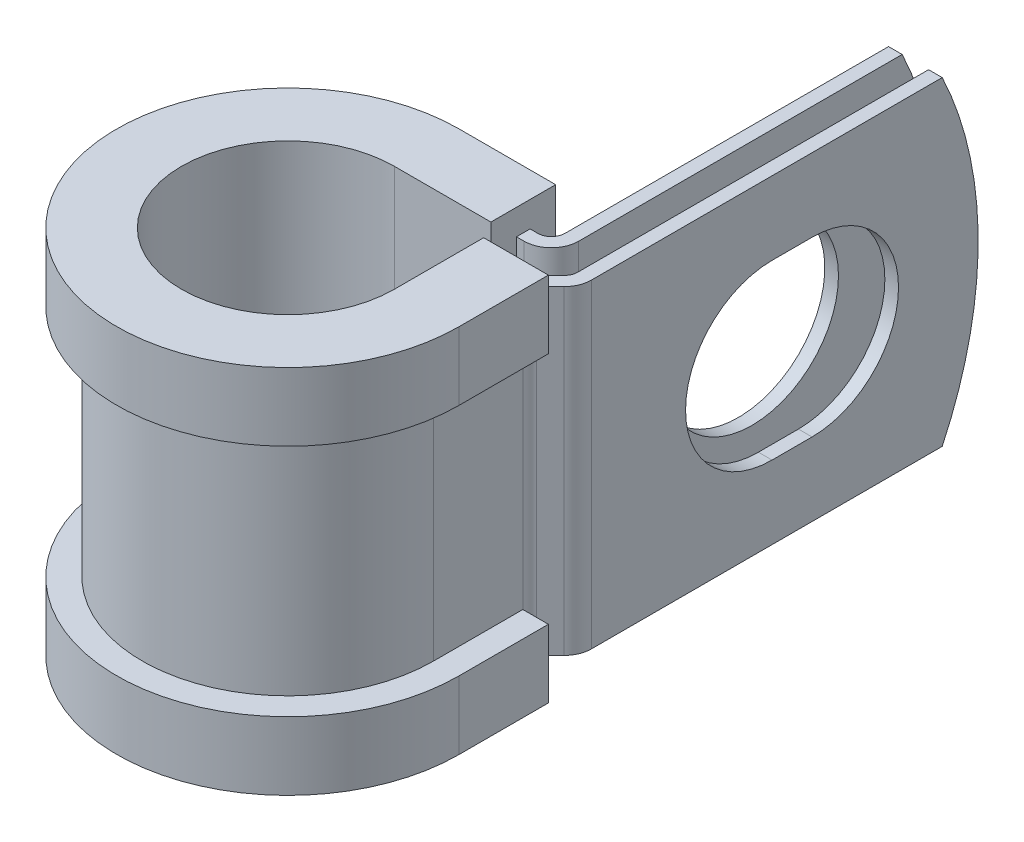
ISO-10303-21;
HEADER;
FILE_DESCRIPTION(('STEP AP214'),'2;1');
FILE_NAME('part.step','',(''),(''),'','','');
FILE_SCHEMA(('AUTOMOTIVE_DESIGN { 1 0 10303 214 1 1 1 1 }'));
ENDSEC;
DATA;
#1=APPLICATION_CONTEXT('core data for automotive mechanical design processes');
#2=APPLICATION_PROTOCOL_DEFINITION('international standard','automotive_design',2000,#1);
#3=PRODUCT_CONTEXT('',#1,'mechanical');
#4=PRODUCT('Part','Part','',(#3));
#5=PRODUCT_RELATED_PRODUCT_CATEGORY('part','',(#4));
#6=PRODUCT_DEFINITION_FORMATION('','',#4);
#7=PRODUCT_DEFINITION_CONTEXT('part definition',#1,'design');
#8=PRODUCT_DEFINITION('design','',#6,#7);
#9=PRODUCT_DEFINITION_SHAPE('','',#8);
#10=(LENGTH_UNIT() NAMED_UNIT(*) SI_UNIT(.MILLI.,.METRE.));
#11=(NAMED_UNIT(*) PLANE_ANGLE_UNIT() SI_UNIT($,.RADIAN.));
#12=(NAMED_UNIT(*) SI_UNIT($,.STERADIAN.) SOLID_ANGLE_UNIT());
#13=UNCERTAINTY_MEASURE_WITH_UNIT(LENGTH_MEASURE(1.E-05),#10,'distance_accuracy_value','');
#14=(GEOMETRIC_REPRESENTATION_CONTEXT(3) GLOBAL_UNCERTAINTY_ASSIGNED_CONTEXT((#13)) GLOBAL_UNIT_ASSIGNED_CONTEXT((#10,
#11,#12)) REPRESENTATION_CONTEXT('',''));
#15=CARTESIAN_POINT('',(0.,0.,0.));
#16=DIRECTION('',(0.,0.,1.));
#17=DIRECTION('',(1.,0.,0.));
#18=AXIS2_PLACEMENT_3D('',#15,#16,#17);
#19=CARTESIAN_POINT('',(8.60157438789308,-9.525,-7.874));
#20=DIRECTION('',(0.,1.,0.));
#21=DIRECTION('',(1.,0.,0.));
#22=AXIS2_PLACEMENT_3D('',#19,#20,#21);
#23=PLANE('',#22);
#24=DIRECTION('',(0.,0.,-1.));
#25=VECTOR('',#24,1.);
#26=CARTESIAN_POINT('',(5.75677438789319,-9.525,-7.874));
#27=LINE('',#26,#25);
#28=CARTESIAN_POINT('',(5.75677438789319,-9.525,-7.874));
#29=VERTEX_POINT('',#28);
#30=CARTESIAN_POINT('',(5.7567743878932,-9.525,-8.6868));
#31=VERTEX_POINT('',#30);
#32=EDGE_CURVE('E523',#29,#31,#27,.T.);
#33=ORIENTED_EDGE('',*,*,#32,.T.);
#34=DIRECTION('',(1.,0.,0.));
#35=VECTOR('',#34,1.);
#36=CARTESIAN_POINT('',(0.,-9.525,-8.6868));
#37=LINE('',#36,#35);
#38=CARTESIAN_POINT('',(6.21397438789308,-9.525,-8.6868));
#39=VERTEX_POINT('',#38);
#40=EDGE_CURVE('E410',#39,#31,#37,.F.);
#41=ORIENTED_EDGE('',*,*,#40,.F.);
#42=CARTESIAN_POINT('',(6.21397438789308,-9.525,-9.4996));
#43=DIRECTION('',(0.,1.,0.));
#44=DIRECTION('',(1.,0.,0.));
#45=AXIS2_PLACEMENT_3D('',#42,#43,#44);
#46=CIRCLE('',#45,0.812799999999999);
#47=CARTESIAN_POINT('',(7.02677438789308,-9.525,-9.4996));
#48=VERTEX_POINT('',#47);
#49=EDGE_CURVE('E408',#48,#39,#46,.F.);
#50=ORIENTED_EDGE('',*,*,#49,.F.);
#51=DIRECTION('',(0.,0.,1.));
#52=VECTOR('',#51,1.);
#53=CARTESIAN_POINT('',(7.02677438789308,-9.525,-30.9372));
#54=LINE('',#53,#52);
#55=CARTESIAN_POINT('',(7.02677438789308,-9.525,-28.7926631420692));
#56=VERTEX_POINT('',#55);
#57=EDGE_CURVE('E406',#56,#48,#54,.T.);
#58=ORIENTED_EDGE('',*,*,#57,.F.);
#59=DIRECTION('',(-1.,0.,0.));
#60=VECTOR('',#59,1.);
#61=CARTESIAN_POINT('',(10.2271743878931,-9.525,-28.7926631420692));
#62=LINE('',#61,#60);
#63=CARTESIAN_POINT('',(7.83957438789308,-9.525,-28.7926631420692));
#64=VERTEX_POINT('',#63);
#65=EDGE_CURVE('E12',#64,#56,#62,.T.);
#66=ORIENTED_EDGE('',*,*,#65,.F.);
#67=DIRECTION('',(0.,0.,1.));
#68=VECTOR('',#67,1.);
#69=CARTESIAN_POINT('',(7.83957438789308,-9.525,-30.9372));
#70=LINE('',#69,#68);
#71=CARTESIAN_POINT('',(7.83957438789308,-9.525,-9.4996));
#72=VERTEX_POINT('',#71);
#73=EDGE_CURVE('E404',#64,#72,#70,.T.);
#74=ORIENTED_EDGE('',*,*,#73,.T.);
#75=CARTESIAN_POINT('',(6.21397438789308,-9.525,-9.4996));
#76=DIRECTION('',(0.,-1.,0.));
#77=DIRECTION('',(0.,0.,1.));
#78=AXIS2_PLACEMENT_3D('',#75,#76,#77);
#79=CIRCLE('',#78,1.6256);
#80=CARTESIAN_POINT('',(6.21397438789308,-9.525,-7.874));
#81=VERTEX_POINT('',#80);
#82=EDGE_CURVE('E401',#72,#81,#79,.T.);
#83=ORIENTED_EDGE('',*,*,#82,.T.);
#84=DIRECTION('',(-1.,0.,0.));
#85=VECTOR('',#84,1.);
#86=CARTESIAN_POINT('',(0.,-9.525,-7.874));
#87=LINE('',#86,#85);
#88=EDGE_CURVE('E398',#81,#29,#87,.T.);
#89=ORIENTED_EDGE('',*,*,#88,.T.);
#90=EDGE_LOOP('',(#33,#41,#50,#58,#66,#74,#83,#89));
#91=FACE_BOUND('',#90,.T.);
#92=ADVANCED_FACE('F54',(#91),#23,.F.);
#93=CARTESIAN_POINT('',(8.60157438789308,9.525,-7.874));
#94=DIRECTION('',(0.,1.,0.));
#95=DIRECTION('',(1.,0.,0.));
#96=AXIS2_PLACEMENT_3D('',#93,#94,#95);
#97=PLANE('',#96);
#98=DIRECTION('',(1.,0.,0.));
#99=VECTOR('',#98,1.);
#100=CARTESIAN_POINT('',(0.,9.525,-8.6868));
#101=LINE('',#100,#99);
#102=CARTESIAN_POINT('',(6.21397438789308,9.525,-8.6868));
#103=VERTEX_POINT('',#102);
#104=CARTESIAN_POINT('',(5.7567743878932,9.525,-8.6868));
#105=VERTEX_POINT('',#104);
#106=EDGE_CURVE('E368',#103,#105,#101,.F.);
#107=ORIENTED_EDGE('',*,*,#106,.T.);
#108=DIRECTION('',(0.,0.,1.));
#109=VECTOR('',#108,1.);
#110=CARTESIAN_POINT('',(5.7567743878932,9.525,-8.6868));
#111=LINE('',#110,#109);
#112=CARTESIAN_POINT('',(5.75677438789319,9.525,-7.874));
#113=VERTEX_POINT('',#112);
#114=EDGE_CURVE('E517',#105,#113,#111,.T.);
#115=ORIENTED_EDGE('',*,*,#114,.T.);
#116=DIRECTION('',(-1.,0.,0.));
#117=VECTOR('',#116,1.);
#118=CARTESIAN_POINT('',(0.,9.525,-7.874));
#119=LINE('',#118,#117);
#120=CARTESIAN_POINT('',(6.21397438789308,9.525,-7.874));
#121=VERTEX_POINT('',#120);
#122=EDGE_CURVE('E625',#121,#113,#119,.T.);
#123=ORIENTED_EDGE('',*,*,#122,.F.);
#124=CARTESIAN_POINT('',(6.21397438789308,9.525,-9.4996));
#125=DIRECTION('',(0.,-1.,0.));
#126=DIRECTION('',(0.,0.,1.));
#127=AXIS2_PLACEMENT_3D('',#124,#125,#126);
#128=CIRCLE('',#127,1.6256);
#129=CARTESIAN_POINT('',(7.83957438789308,9.525,-9.4996));
#130=VERTEX_POINT('',#129);
#131=EDGE_CURVE('E370',#130,#121,#128,.T.);
#132=ORIENTED_EDGE('',*,*,#131,.F.);
#133=DIRECTION('',(0.,0.,1.));
#134=VECTOR('',#133,1.);
#135=CARTESIAN_POINT('',(7.83957438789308,9.525,-30.9372));
#136=LINE('',#135,#134);
#137=CARTESIAN_POINT('',(7.83957438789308,9.525,-28.7926631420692));
#138=VERTEX_POINT('',#137);
#139=EDGE_CURVE('E361',#138,#130,#136,.T.);
#140=ORIENTED_EDGE('',*,*,#139,.F.);
#141=DIRECTION('',(-1.,0.,0.));
#142=VECTOR('',#141,1.);
#143=CARTESIAN_POINT('',(10.2271743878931,9.525,-28.7926631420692));
#144=LINE('',#143,#142);
#145=CARTESIAN_POINT('',(7.02677438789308,9.525,-28.7926631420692));
#146=VERTEX_POINT('',#145);
#147=EDGE_CURVE('E62',#138,#146,#144,.T.);
#148=ORIENTED_EDGE('',*,*,#147,.T.);
#149=DIRECTION('',(0.,0.,1.));
#150=VECTOR('',#149,1.);
#151=CARTESIAN_POINT('',(7.02677438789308,9.525,-30.9372));
#152=LINE('',#151,#150);
#153=CARTESIAN_POINT('',(7.02677438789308,9.525,-9.4996));
#154=VERTEX_POINT('',#153);
#155=EDGE_CURVE('E358',#146,#154,#152,.T.);
#156=ORIENTED_EDGE('',*,*,#155,.T.);
#157=CARTESIAN_POINT('',(6.21397438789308,9.525,-9.4996));
#158=DIRECTION('',(0.,1.,0.));
#159=DIRECTION('',(1.,0.,0.));
#160=AXIS2_PLACEMENT_3D('',#157,#158,#159);
#161=CIRCLE('',#160,0.812799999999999);
#162=EDGE_CURVE('E366',#154,#103,#161,.F.);
#163=ORIENTED_EDGE('',*,*,#162,.T.);
#164=EDGE_LOOP('',(#107,#115,#123,#132,#140,#148,#156,#163));
#165=FACE_BOUND('',#164,.T.);
#166=ADVANCED_FACE('F357',(#165),#97,.T.);
#167=CARTESIAN_POINT('',(0.,9.525,-7.874));
#168=DIRECTION('',(0.,0.,1.));
#169=DIRECTION('',(1.,0.,0.));
#170=AXIS2_PLACEMENT_3D('',#167,#168,#169);
#171=PLANE('',#170);
#172=ORIENTED_EDGE('',*,*,#122,.T.);
#173=DIRECTION('',(0.,-1.,0.));
#174=VECTOR('',#173,1.);
#175=CARTESIAN_POINT('',(5.75677438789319,9.525,-7.874));
#176=LINE('',#175,#174);
#177=EDGE_CURVE('E520',#113,#29,#176,.T.);
#178=ORIENTED_EDGE('',*,*,#177,.T.);
#179=ORIENTED_EDGE('',*,*,#88,.F.);
#180=DIRECTION('',(0.,-1.,0.));
#181=VECTOR('',#180,1.);
#182=CARTESIAN_POINT('',(6.21397438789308,9.525,-7.874));
#183=LINE('',#182,#181);
#184=EDGE_CURVE('E344',#121,#81,#183,.T.);
#185=ORIENTED_EDGE('',*,*,#184,.F.);
#186=EDGE_LOOP('',(#172,#178,#179,#185));
#187=FACE_BOUND('',#186,.T.);
#188=ADVANCED_FACE('F635',(#187),#171,.T.);
#189=CARTESIAN_POINT('',(10.2271743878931,9.525,-7.874));
#190=DIRECTION('',(-1.,0.,0.));
#191=DIRECTION('',(0.,0.,1.));
#192=AXIS2_PLACEMENT_3D('',#189,#190,#191);
#193=PLANE('',#192);
#194=CARTESIAN_POINT('',(10.2271743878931,0.,-21.0311999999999));
#195=DIRECTION('',(1.,0.,0.));
#196=DIRECTION('',(0.,0.,-1.));
#197=AXIS2_PLACEMENT_3D('',#194,#195,#196);
#198=CIRCLE('',#197,5.1562);
#199=CARTESIAN_POINT('',(10.2271743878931,-5.1562,-21.0312000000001));
#200=VERTEX_POINT('',#199);
#201=CARTESIAN_POINT('',(10.2271743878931,5.1562,-21.0312000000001));
#202=VERTEX_POINT('',#201);
#203=EDGE_CURVE('E580',#200,#202,#198,.T.);
#204=ORIENTED_EDGE('',*,*,#203,.F.);
#205=DIRECTION('',(0.,0.,-1.));
#206=VECTOR('',#205,1.);
#207=CARTESIAN_POINT('',(10.2271743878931,-5.1562,-18.6435999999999));
#208=LINE('',#207,#206);
#209=CARTESIAN_POINT('',(10.2271743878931,-5.1562,-18.6435999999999));
#210=VERTEX_POINT('',#209);
#211=EDGE_CURVE('E583',#210,#200,#208,.T.);
#212=ORIENTED_EDGE('',*,*,#211,.F.);
#213=CARTESIAN_POINT('',(10.2271743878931,0.,-18.6435999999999));
#214=DIRECTION('',(1.,0.,0.));
#215=DIRECTION('',(0.,0.,-1.));
#216=AXIS2_PLACEMENT_3D('',#213,#214,#215);
#217=CIRCLE('',#216,5.1562);
#218=CARTESIAN_POINT('',(10.2271743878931,5.1562,-18.6435999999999));
#219=VERTEX_POINT('',#218);
#220=EDGE_CURVE('E576',#219,#210,#217,.T.);
#221=ORIENTED_EDGE('',*,*,#220,.F.);
#222=DIRECTION('',(0.,0.,1.));
#223=VECTOR('',#222,1.);
#224=CARTESIAN_POINT('',(10.2271743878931,5.1562,-18.6435999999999));
#225=LINE('',#224,#223);
#226=EDGE_CURVE('E577',#202,#219,#225,.T.);
#227=ORIENTED_EDGE('',*,*,#226,.F.);
#228=EDGE_LOOP('',(#204,#212,#221,#227));
#229=FACE_BOUND('',#228,.T.);
#230=DIRECTION('',(0.,0.,-1.));
#231=VECTOR('',#230,1.);
#232=CARTESIAN_POINT('',(10.2271743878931,-9.525,-7.874));
#233=LINE('',#232,#231);
#234=CARTESIAN_POINT('',(10.2271743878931,-9.525,-7.874));
#235=VERTEX_POINT('',#234);
#236=CARTESIAN_POINT('',(10.2271743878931,-9.525,-28.7926631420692));
#237=VERTEX_POINT('',#236);
#238=EDGE_CURVE('E382',#235,#237,#233,.T.);
#239=ORIENTED_EDGE('',*,*,#238,.T.);
#240=CARTESIAN_POINT('',(10.2271743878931,0.,-8.7122));
#241=DIRECTION('',(-1.,0.,0.));
#242=DIRECTION('',(0.,0.,1.));
#243=AXIS2_PLACEMENT_3D('',#240,#241,#242);
#244=CIRCLE('',#243,22.225);
#245=CARTESIAN_POINT('',(10.2271743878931,9.525,-28.7926631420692));
#246=VERTEX_POINT('',#245);
#247=EDGE_CURVE('E568',#246,#237,#244,.T.);
#248=ORIENTED_EDGE('',*,*,#247,.F.);
#249=DIRECTION('',(0.,0.,-1.));
#250=VECTOR('',#249,1.);
#251=CARTESIAN_POINT('',(10.2271743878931,9.525,-7.874));
#252=LINE('',#251,#250);
#253=CARTESIAN_POINT('',(10.2271743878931,9.525,-7.874));
#254=VERTEX_POINT('',#253);
#255=EDGE_CURVE('E419',#254,#246,#252,.T.);
#256=ORIENTED_EDGE('',*,*,#255,.F.);
#257=DIRECTION('',(0.,-1.,0.));
#258=VECTOR('',#257,1.);
#259=CARTESIAN_POINT('',(10.2271743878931,9.525,-7.874));
#260=LINE('',#259,#258);
#261=EDGE_CURVE('E381',#254,#235,#260,.T.);
#262=ORIENTED_EDGE('',*,*,#261,.T.);
#263=EDGE_LOOP('',(#239,#248,#256,#262));
#264=FACE_BOUND('',#263,.T.);
#265=ADVANCED_FACE('F56',(#229,#264),#193,.F.);
#266=CARTESIAN_POINT('',(9.41437438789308,9.525,-7.874));
#267=DIRECTION('',(-1.,0.,0.));
#268=DIRECTION('',(0.,0.,1.));
#269=AXIS2_PLACEMENT_3D('',#266,#267,#268);
#270=PLANE('',#269);
#271=DIRECTION('',(0.,0.,-1.));
#272=VECTOR('',#271,1.);
#273=CARTESIAN_POINT('',(9.41437438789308,-5.1562,-18.6435999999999));
#274=LINE('',#273,#272);
#275=CARTESIAN_POINT('',(9.41437438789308,-5.1562,-18.6435999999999));
#276=VERTEX_POINT('',#275);
#277=CARTESIAN_POINT('',(9.41437438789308,-5.1562,-21.0312000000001));
#278=VERTEX_POINT('',#277);
#279=EDGE_CURVE('E579',#276,#278,#274,.T.);
#280=ORIENTED_EDGE('',*,*,#279,.T.);
#281=CARTESIAN_POINT('',(9.41437438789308,0.,-21.0311999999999));
#282=DIRECTION('',(-1.,0.,0.));
#283=DIRECTION('',(0.,0.,1.));
#284=AXIS2_PLACEMENT_3D('',#281,#282,#283);
#285=CIRCLE('',#284,5.1562);
#286=CARTESIAN_POINT('',(9.41437438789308,5.1562,-21.0312000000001));
#287=VERTEX_POINT('',#286);
#288=EDGE_CURVE('E600',#278,#287,#285,.F.);
#289=ORIENTED_EDGE('',*,*,#288,.T.);
#290=DIRECTION('',(0.,0.,1.));
#291=VECTOR('',#290,1.);
#292=CARTESIAN_POINT('',(9.41437438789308,5.1562,-18.6435999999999));
#293=LINE('',#292,#291);
#294=CARTESIAN_POINT('',(9.41437438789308,5.1562,-18.6435999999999));
#295=VERTEX_POINT('',#294);
#296=EDGE_CURVE('E596',#287,#295,#293,.T.);
#297=ORIENTED_EDGE('',*,*,#296,.T.);
#298=CARTESIAN_POINT('',(9.41437438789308,0.,-18.6435999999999));
#299=DIRECTION('',(-1.,0.,0.));
#300=DIRECTION('',(0.,0.,1.));
#301=AXIS2_PLACEMENT_3D('',#298,#299,#300);
#302=CIRCLE('',#301,5.1562);
#303=EDGE_CURVE('E591',#295,#276,#302,.F.);
#304=ORIENTED_EDGE('',*,*,#303,.T.);
#305=EDGE_LOOP('',(#280,#289,#297,#304));
#306=FACE_BOUND('',#305,.T.);
#307=CARTESIAN_POINT('',(9.41437438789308,0.,-8.7122));
#308=DIRECTION('',(-1.,0.,0.));
#309=DIRECTION('',(0.,0.,1.));
#310=AXIS2_PLACEMENT_3D('',#307,#308,#309);
#311=CIRCLE('',#310,22.225);
#312=CARTESIAN_POINT('',(9.41437438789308,9.525,-28.7926631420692));
#313=VERTEX_POINT('',#312);
#314=CARTESIAN_POINT('',(9.41437438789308,-9.525,-28.7926631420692));
#315=VERTEX_POINT('',#314);
#316=EDGE_CURVE('E76',#313,#315,#311,.T.);
#317=ORIENTED_EDGE('',*,*,#316,.T.);
#318=DIRECTION('',(0.,0.,-1.));
#319=VECTOR('',#318,1.);
#320=CARTESIAN_POINT('',(9.41437438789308,-9.525,-7.874));
#321=LINE('',#320,#319);
#322=CARTESIAN_POINT('',(9.41437438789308,-9.525,-7.874));
#323=VERTEX_POINT('',#322);
#324=EDGE_CURVE('E385',#323,#315,#321,.T.);
#325=ORIENTED_EDGE('',*,*,#324,.F.);
#326=DIRECTION('',(0.,-1.,0.));
#327=VECTOR('',#326,1.);
#328=CARTESIAN_POINT('',(9.41437438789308,9.525,-7.874));
#329=LINE('',#328,#327);
#330=CARTESIAN_POINT('',(9.41437438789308,9.525,-7.874));
#331=VERTEX_POINT('',#330);
#332=EDGE_CURVE('E352',#331,#323,#329,.T.);
#333=ORIENTED_EDGE('',*,*,#332,.F.);
#334=DIRECTION('',(0.,0.,-1.));
#335=VECTOR('',#334,1.);
#336=CARTESIAN_POINT('',(9.41437438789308,9.525,-7.874));
#337=LINE('',#336,#335);
#338=EDGE_CURVE('E615',#331,#313,#337,.T.);
#339=ORIENTED_EDGE('',*,*,#338,.T.);
#340=EDGE_LOOP('',(#317,#325,#333,#339));
#341=FACE_BOUND('',#340,.T.);
#342=ADVANCED_FACE('F689',(#306,#341),#270,.T.);
#343=CARTESIAN_POINT('',(7.83957438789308,9.525,-30.9372));
#344=DIRECTION('',(1.,0.,0.));
#345=DIRECTION('',(0.,0.,-1.));
#346=AXIS2_PLACEMENT_3D('',#343,#344,#345);
#347=PLANE('',#346);
#348=CARTESIAN_POINT('',(7.83957438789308,0.,-19.8374));
#349=DIRECTION('',(1.,0.,0.));
#350=DIRECTION('',(0.,0.,-1.));
#351=AXIS2_PLACEMENT_3D('',#348,#349,#350);
#352=CIRCLE('',#351,5.1562);
#353=CARTESIAN_POINT('',(7.83957438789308,0.,-24.9936));
#354=VERTEX_POINT('',#353);
#355=EDGE_CURVE('E386',#354,#354,#352,.F.);
#356=ORIENTED_EDGE('',*,*,#355,.T.);
#357=EDGE_LOOP('',(#356));
#358=FACE_BOUND('',#357,.T.);
#359=ORIENTED_EDGE('',*,*,#73,.F.);
#360=CARTESIAN_POINT('',(7.83957438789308,0.,-8.7122));
#361=DIRECTION('',(1.,0.,0.));
#362=DIRECTION('',(0.,0.,-1.));
#363=AXIS2_PLACEMENT_3D('',#360,#361,#362);
#364=CIRCLE('',#363,22.225);
#365=EDGE_CURVE('E573',#64,#138,#364,.T.);
#366=ORIENTED_EDGE('',*,*,#365,.T.);
#367=ORIENTED_EDGE('',*,*,#139,.T.);
#368=DIRECTION('',(0.,-1.,0.));
#369=VECTOR('',#368,1.);
#370=CARTESIAN_POINT('',(7.83957438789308,9.525,-9.4996));
#371=LINE('',#370,#369);
#372=EDGE_CURVE('E341',#130,#72,#371,.T.);
#373=ORIENTED_EDGE('',*,*,#372,.T.);
#374=EDGE_LOOP('',(#359,#366,#367,#373));
#375=FACE_BOUND('',#374,.T.);
#376=ADVANCED_FACE('F641',(#358,#375),#347,.T.);
#377=CARTESIAN_POINT('',(7.02677438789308,9.525,-30.9372));
#378=DIRECTION('',(1.,0.,0.));
#379=DIRECTION('',(0.,0.,-1.));
#380=AXIS2_PLACEMENT_3D('',#377,#378,#379);
#381=PLANE('',#380);
#382=CARTESIAN_POINT('',(7.02677438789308,0.,-19.8374));
#383=DIRECTION('',(-1.,0.,0.));
#384=DIRECTION('',(0.,0.,1.));
#385=AXIS2_PLACEMENT_3D('',#382,#383,#384);
#386=CIRCLE('',#385,5.1562);
#387=CARTESIAN_POINT('',(7.02677438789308,0.,-14.6812));
#388=VERTEX_POINT('',#387);
#389=EDGE_CURVE('E608',#388,#388,#386,.T.);
#390=ORIENTED_EDGE('',*,*,#389,.F.);
#391=EDGE_LOOP('',(#390));
#392=FACE_BOUND('',#391,.T.);
#393=CARTESIAN_POINT('',(7.02677438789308,0.,-8.7122));
#394=DIRECTION('',(-1.,0.,0.));
#395=DIRECTION('',(0.,0.,1.));
#396=AXIS2_PLACEMENT_3D('',#393,#394,#395);
#397=CIRCLE('',#396,22.225);
#398=EDGE_CURVE('E68',#146,#56,#397,.T.);
#399=ORIENTED_EDGE('',*,*,#398,.T.);
#400=ORIENTED_EDGE('',*,*,#57,.T.);
#401=DIRECTION('',(0.,-1.,0.));
#402=VECTOR('',#401,1.);
#403=CARTESIAN_POINT('',(7.02677438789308,9.525,-9.4996));
#404=LINE('',#403,#402);
#405=EDGE_CURVE('E338',#154,#48,#404,.T.);
#406=ORIENTED_EDGE('',*,*,#405,.F.);
#407=ORIENTED_EDGE('',*,*,#155,.F.);
#408=EDGE_LOOP('',(#399,#400,#406,#407));
#409=FACE_BOUND('',#408,.T.);
#410=ADVANCED_FACE('F364',(#392,#409),#381,.F.);
#411=CARTESIAN_POINT('',(9.4996,-9.525,-5.32360726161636));
#412=DIRECTION('',(0.,1.,0.));
#413=DIRECTION('',(1.,0.,0.));
#414=AXIS2_PLACEMENT_3D('',#411,#412,#413);
#415=CIRCLE('',#414,0.8128);
#416=CARTESIAN_POINT('',(8.6868,-9.525,-5.32360726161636));
#417=VERTEX_POINT('',#416);
#418=CARTESIAN_POINT('',(8.92486360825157,-9.525,-5.89834365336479));
#419=VERTEX_POINT('',#418);
#420=EDGE_CURVE('E413',#417,#419,#415,.F.);
#421=ORIENTED_EDGE('',*,*,#420,.F.);
#422=DIRECTION('',(1.,0.,0.));
#423=VECTOR('',#422,1.);
#424=CARTESIAN_POINT('',(7.874,-9.525,-5.32360726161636));
#425=LINE('',#424,#423);
#426=CARTESIAN_POINT('',(7.874,-9.525,-5.32360726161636));
#427=VERTEX_POINT('',#426);
#428=EDGE_CURVE('E451',#427,#417,#425,.T.);
#429=ORIENTED_EDGE('',*,*,#428,.F.);
#430=CARTESIAN_POINT('',(9.4996,-9.525,-5.32360726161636));
#431=DIRECTION('',(0.,-1.,0.));
#432=DIRECTION('',(0.,0.,1.));
#433=AXIS2_PLACEMENT_3D('',#430,#431,#432);
#434=CIRCLE('',#433,1.6256);
#435=CARTESIAN_POINT('',(8.35012721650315,-9.525,-6.47308004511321));
#436=VERTEX_POINT('',#435);
#437=EDGE_CURVE('E395',#427,#436,#434,.T.);
#438=ORIENTED_EDGE('',*,*,#437,.T.);
#439=DIRECTION('',(0.707106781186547,0.,-0.707106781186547));
#440=VECTOR('',#439,1.);
#441=CARTESIAN_POINT('',(8.35012721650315,-9.525,-6.47308004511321));
#442=LINE('',#441,#440);
#443=CARTESIAN_POINT('',(9.17631077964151,-9.525,-7.29926360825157));
#444=VERTEX_POINT('',#443);
#445=EDGE_CURVE('E392',#436,#444,#442,.T.);
#446=ORIENTED_EDGE('',*,*,#445,.T.);
#447=CARTESIAN_POINT('',(8.60157438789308,-9.525,-7.874));
#448=DIRECTION('',(0.,1.,0.));
#449=DIRECTION('',(0.,0.,1.));
#450=AXIS2_PLACEMENT_3D('',#447,#448,#449);
#451=CIRCLE('',#450,0.812800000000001);
#452=EDGE_CURVE('E389',#444,#323,#451,.T.);
#453=ORIENTED_EDGE('',*,*,#452,.T.);
#454=ORIENTED_EDGE('',*,*,#324,.T.);
#455=DIRECTION('',(-1.,0.,0.));
#456=VECTOR('',#455,1.);
#457=CARTESIAN_POINT('',(10.2271743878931,-9.525,-28.7926631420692));
#458=LINE('',#457,#456);
#459=EDGE_CURVE('E566',#237,#315,#458,.T.);
#460=ORIENTED_EDGE('',*,*,#459,.F.);
#461=ORIENTED_EDGE('',*,*,#238,.F.);
#462=CARTESIAN_POINT('',(8.60157438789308,-9.525,-7.874));
#463=DIRECTION('',(0.,1.,0.));
#464=DIRECTION('',(1.,0.,0.));
#465=AXIS2_PLACEMENT_3D('',#462,#463,#464);
#466=CIRCLE('',#465,1.6256);
#467=CARTESIAN_POINT('',(9.75104717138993,-9.525,-6.72452721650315));
#468=VERTEX_POINT('',#467);
#469=EDGE_CURVE('E417',#468,#235,#466,.T.);
#470=ORIENTED_EDGE('',*,*,#469,.F.);
#471=DIRECTION('',(0.707106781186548,0.,-0.707106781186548));
#472=VECTOR('',#471,1.);
#473=CARTESIAN_POINT('',(8.92486360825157,-9.525,-5.89834365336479));
#474=LINE('',#473,#472);
#475=EDGE_CURVE('E415',#419,#468,#474,.T.);
#476=ORIENTED_EDGE('',*,*,#475,.F.);
#477=EDGE_LOOP('',(#421,#429,#438,#446,#453,#454,#460,#461,#470,#476));
#478=FACE_BOUND('',#477,.T.);
#479=ADVANCED_FACE('F675',(#478),#23,.F.);
#480=DIRECTION('',(-1.,0.,0.));
#481=VECTOR('',#480,1.);
#482=CARTESIAN_POINT('',(8.6868,9.525,-5.32360726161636));
#483=LINE('',#482,#481);
#484=CARTESIAN_POINT('',(8.6868,9.525,-5.32360726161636));
#485=VERTEX_POINT('',#484);
#486=CARTESIAN_POINT('',(7.874,9.525,-5.32360726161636));
#487=VERTEX_POINT('',#486);
#488=EDGE_CURVE('E440',#485,#487,#483,.T.);
#489=ORIENTED_EDGE('',*,*,#488,.F.);
#490=CARTESIAN_POINT('',(9.4996,9.525,-5.32360726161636));
#491=DIRECTION('',(0.,1.,0.));
#492=DIRECTION('',(1.,0.,0.));
#493=AXIS2_PLACEMENT_3D('',#490,#491,#492);
#494=CIRCLE('',#493,0.8128);
#495=CARTESIAN_POINT('',(8.92486360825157,9.525,-5.89834365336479));
#496=VERTEX_POINT('',#495);
#497=EDGE_CURVE('E375',#485,#496,#494,.F.);
#498=ORIENTED_EDGE('',*,*,#497,.T.);
#499=DIRECTION('',(0.707106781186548,0.,-0.707106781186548));
#500=VECTOR('',#499,1.);
#501=CARTESIAN_POINT('',(8.92486360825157,9.525,-5.89834365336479));
#502=LINE('',#501,#500);
#503=CARTESIAN_POINT('',(9.75104717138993,9.525,-6.72452721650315));
#504=VERTEX_POINT('',#503);
#505=EDGE_CURVE('E377',#496,#504,#502,.T.);
#506=ORIENTED_EDGE('',*,*,#505,.T.);
#507=CARTESIAN_POINT('',(8.60157438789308,9.525,-7.874));
#508=DIRECTION('',(0.,1.,0.));
#509=DIRECTION('',(1.,0.,0.));
#510=AXIS2_PLACEMENT_3D('',#507,#508,#509);
#511=CIRCLE('',#510,1.6256);
#512=EDGE_CURVE('E379',#504,#254,#511,.T.);
#513=ORIENTED_EDGE('',*,*,#512,.T.);
#514=ORIENTED_EDGE('',*,*,#255,.T.);
#515=DIRECTION('',(-1.,0.,0.));
#516=VECTOR('',#515,1.);
#517=CARTESIAN_POINT('',(10.2271743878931,9.525,-28.7926631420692));
#518=LINE('',#517,#516);
#519=EDGE_CURVE('E570',#246,#313,#518,.T.);
#520=ORIENTED_EDGE('',*,*,#519,.T.);
#521=ORIENTED_EDGE('',*,*,#338,.F.);
#522=CARTESIAN_POINT('',(8.60157438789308,9.525,-7.874));
#523=DIRECTION('',(0.,1.,0.));
#524=DIRECTION('',(0.,0.,1.));
#525=AXIS2_PLACEMENT_3D('',#522,#523,#524);
#526=CIRCLE('',#525,0.812800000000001);
#527=CARTESIAN_POINT('',(9.17631077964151,9.525,-7.29926360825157));
#528=VERTEX_POINT('',#527);
#529=EDGE_CURVE('E618',#528,#331,#526,.T.);
#530=ORIENTED_EDGE('',*,*,#529,.F.);
#531=DIRECTION('',(0.707106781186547,0.,-0.707106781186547));
#532=VECTOR('',#531,1.);
#533=CARTESIAN_POINT('',(8.35012721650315,9.525,-6.47308004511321));
#534=LINE('',#533,#532);
#535=CARTESIAN_POINT('',(8.35012721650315,9.525,-6.47308004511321));
#536=VERTEX_POINT('',#535);
#537=EDGE_CURVE('E621',#536,#528,#534,.T.);
#538=ORIENTED_EDGE('',*,*,#537,.F.);
#539=CARTESIAN_POINT('',(9.4996,9.525,-5.32360726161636));
#540=DIRECTION('',(0.,-1.,0.));
#541=DIRECTION('',(0.,0.,1.));
#542=AXIS2_PLACEMENT_3D('',#539,#540,#541);
#543=CIRCLE('',#542,1.6256);
#544=EDGE_CURVE('E450',#487,#536,#543,.T.);
#545=ORIENTED_EDGE('',*,*,#544,.F.);
#546=EDGE_LOOP('',(#489,#498,#506,#513,#514,#520,#521,#530,#538,#545));
#547=FACE_BOUND('',#546,.T.);
#548=ADVANCED_FACE('F447',(#547),#97,.T.);
#549=CARTESIAN_POINT('',(8.60157438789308,9.525,-7.874));
#550=DIRECTION('',(0.,-1.,0.));
#551=DIRECTION('',(0.,0.,-1.));
#552=AXIS2_PLACEMENT_3D('',#549,#550,#551);
#553=CYLINDRICAL_SURFACE('',#552,0.812800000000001);
#554=ORIENTED_EDGE('',*,*,#452,.F.);
#555=DIRECTION('',(0.,-1.,0.));
#556=VECTOR('',#555,1.);
#557=CARTESIAN_POINT('',(9.17631077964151,9.525,-7.29926360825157));
#558=LINE('',#557,#556);
#559=EDGE_CURVE('E350',#528,#444,#558,.T.);
#560=ORIENTED_EDGE('',*,*,#559,.F.);
#561=ORIENTED_EDGE('',*,*,#529,.T.);
#562=ORIENTED_EDGE('',*,*,#332,.T.);
#563=EDGE_LOOP('',(#554,#560,#561,#562));
#564=FACE_BOUND('',#563,.T.);
#565=ADVANCED_FACE('F685',(#564),#553,.F.);
#566=CARTESIAN_POINT('',(8.35012721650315,9.525,-6.47308004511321));
#567=DIRECTION('',(-0.707106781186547,0.,-0.707106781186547));
#568=DIRECTION('',(-0.707106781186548,0.,0.707106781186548));
#569=AXIS2_PLACEMENT_3D('',#566,#567,#568);
#570=PLANE('',#569);
#571=ORIENTED_EDGE('',*,*,#445,.F.);
#572=DIRECTION('',(0.,-1.,0.));
#573=VECTOR('',#572,1.);
#574=CARTESIAN_POINT('',(8.35012721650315,9.525,-6.47308004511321));
#575=LINE('',#574,#573);
#576=EDGE_CURVE('E348',#536,#436,#575,.T.);
#577=ORIENTED_EDGE('',*,*,#576,.F.);
#578=ORIENTED_EDGE('',*,*,#537,.T.);
#579=ORIENTED_EDGE('',*,*,#559,.T.);
#580=EDGE_LOOP('',(#571,#577,#578,#579));
#581=FACE_BOUND('',#580,.T.);
#582=ADVANCED_FACE('F680',(#581),#570,.T.);
#583=CARTESIAN_POINT('',(9.4996,9.525,-5.32360726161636));
#584=DIRECTION('',(0.,-1.,0.));
#585=DIRECTION('',(0.,0.,-1.));
#586=AXIS2_PLACEMENT_3D('',#583,#584,#585);
#587=CYLINDRICAL_SURFACE('',#586,1.6256);
#588=ORIENTED_EDGE('',*,*,#437,.F.);
#589=DIRECTION('',(0.,-1.,0.));
#590=VECTOR('',#589,1.);
#591=CARTESIAN_POINT('',(7.874,9.525,-5.32360726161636));
#592=LINE('',#591,#590);
#593=EDGE_CURVE('E346',#487,#427,#592,.T.);
#594=ORIENTED_EDGE('',*,*,#593,.F.);
#595=ORIENTED_EDGE('',*,*,#544,.T.);
#596=ORIENTED_EDGE('',*,*,#576,.T.);
#597=EDGE_LOOP('',(#588,#594,#595,#596));
#598=FACE_BOUND('',#597,.T.);
#599=ADVANCED_FACE('F677',(#598),#587,.T.);
#600=CARTESIAN_POINT('',(6.21397438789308,9.525,-9.4996));
#601=DIRECTION('',(0.,-1.,0.));
#602=DIRECTION('',(0.,0.,-1.));
#603=AXIS2_PLACEMENT_3D('',#600,#601,#602);
#604=CYLINDRICAL_SURFACE('',#603,1.6256);
#605=ORIENTED_EDGE('',*,*,#82,.F.);
#606=ORIENTED_EDGE('',*,*,#372,.F.);
#607=ORIENTED_EDGE('',*,*,#131,.T.);
#608=ORIENTED_EDGE('',*,*,#184,.T.);
#609=EDGE_LOOP('',(#605,#606,#607,#608));
#610=FACE_BOUND('',#609,.T.);
#611=ADVANCED_FACE('F631',(#610),#604,.T.);
#612=CARTESIAN_POINT('',(6.21397438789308,9.525,-9.4996));
#613=DIRECTION('',(0.,-1.,0.));
#614=DIRECTION('',(0.,0.,-1.));
#615=AXIS2_PLACEMENT_3D('',#612,#613,#614);
#616=CYLINDRICAL_SURFACE('',#615,0.812799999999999);
#617=ORIENTED_EDGE('',*,*,#49,.T.);
#618=DIRECTION('',(0.,-1.,0.));
#619=VECTOR('',#618,1.);
#620=CARTESIAN_POINT('',(6.21397438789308,9.525,-8.6868));
#621=LINE('',#620,#619);
#622=EDGE_CURVE('E329',#103,#39,#621,.T.);
#623=ORIENTED_EDGE('',*,*,#622,.F.);
#624=ORIENTED_EDGE('',*,*,#162,.F.);
#625=ORIENTED_EDGE('',*,*,#405,.T.);
#626=EDGE_LOOP('',(#617,#623,#624,#625));
#627=FACE_BOUND('',#626,.T.);
#628=ADVANCED_FACE('F646',(#627),#616,.F.);
#629=CARTESIAN_POINT('',(0.,9.525,-8.6868));
#630=DIRECTION('',(0.,0.,1.));
#631=DIRECTION('',(1.,0.,0.));
#632=AXIS2_PLACEMENT_3D('',#629,#630,#631);
#633=PLANE('',#632);
#634=DIRECTION('',(0.,-1.,0.));
#635=VECTOR('',#634,1.);
#636=CARTESIAN_POINT('',(0.,9.525,-8.6868));
#637=LINE('',#636,#635);
#638=CARTESIAN_POINT('',(1.21851113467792E-13,6.985,-8.6868));
#639=VERTEX_POINT('',#638);
#640=CARTESIAN_POINT('',(1.21851113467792E-13,-6.985,-8.6868));
#641=VERTEX_POINT('',#640);
#642=EDGE_CURVE('E320',#639,#641,#637,.T.);
#643=ORIENTED_EDGE('',*,*,#642,.F.);
#644=DIRECTION('',(1.,0.,0.));
#645=VECTOR('',#644,1.);
#646=CARTESIAN_POINT('',(1.21851113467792E-13,6.985,-8.6868));
#647=LINE('',#646,#645);
#648=CARTESIAN_POINT('',(5.7567743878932,6.985,-8.6868));
#649=VERTEX_POINT('',#648);
#650=EDGE_CURVE('E563',#639,#649,#647,.T.);
#651=ORIENTED_EDGE('',*,*,#650,.T.);
#652=DIRECTION('',(0.,1.,0.));
#653=VECTOR('',#652,1.);
#654=CARTESIAN_POINT('',(5.7567743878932,9.525,-8.6868));
#655=LINE('',#654,#653);
#656=EDGE_CURVE('E514',#649,#105,#655,.T.);
#657=ORIENTED_EDGE('',*,*,#656,.T.);
#658=ORIENTED_EDGE('',*,*,#106,.F.);
#659=ORIENTED_EDGE('',*,*,#622,.T.);
#660=ORIENTED_EDGE('',*,*,#40,.T.);
#661=DIRECTION('',(0.,1.,0.));
#662=VECTOR('',#661,1.);
#663=CARTESIAN_POINT('',(5.7567743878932,-9.525,-8.6868));
#664=LINE('',#663,#662);
#665=CARTESIAN_POINT('',(5.7567743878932,-6.985,-8.6868));
#666=VERTEX_POINT('',#665);
#667=EDGE_CURVE('E526',#31,#666,#664,.T.);
#668=ORIENTED_EDGE('',*,*,#667,.T.);
#669=DIRECTION('',(1.,0.,0.));
#670=VECTOR('',#669,1.);
#671=CARTESIAN_POINT('',(1.21851113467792E-13,-6.985,-8.6868));
#672=LINE('',#671,#670);
#673=EDGE_CURVE('E543',#641,#666,#672,.T.);
#674=ORIENTED_EDGE('',*,*,#673,.F.);
#675=EDGE_LOOP('',(#643,#651,#657,#658,#659,#660,#668,#674));
#676=FACE_BOUND('',#675,.T.);
#677=ADVANCED_FACE('F650',(#676),#633,.F.);
#678=CARTESIAN_POINT('',(0.,9.525,0.));
#679=DIRECTION('',(0.,-1.,0.));
#680=DIRECTION('',(0.,0.,-1.));
#681=AXIS2_PLACEMENT_3D('',#678,#679,#680);
#682=CYLINDRICAL_SURFACE('',#681,8.6868);
#683=DIRECTION('',(0.,-1.,0.));
#684=VECTOR('',#683,1.);
#685=CARTESIAN_POINT('',(8.6868,9.525,0.));
#686=LINE('',#685,#684);
#687=CARTESIAN_POINT('',(8.6868,6.985,0.));
#688=VERTEX_POINT('',#687);
#689=CARTESIAN_POINT('',(8.6868,-6.985,0.));
#690=VERTEX_POINT('',#689);
#691=EDGE_CURVE('E318',#688,#690,#686,.T.);
#692=ORIENTED_EDGE('',*,*,#691,.F.);
#693=CARTESIAN_POINT('',(0.,6.985,0.));
#694=DIRECTION('',(0.,-1.,0.));
#695=DIRECTION('',(0.,0.,-1.));
#696=AXIS2_PLACEMENT_3D('',#693,#694,#695);
#697=CIRCLE('',#696,8.6868);
#698=EDGE_CURVE('E512',#688,#639,#697,.T.);
#699=ORIENTED_EDGE('',*,*,#698,.T.);
#700=ORIENTED_EDGE('',*,*,#642,.T.);
#701=CARTESIAN_POINT('',(0.,-6.985,0.));
#702=DIRECTION('',(0.,-1.,0.));
#703=DIRECTION('',(0.,0.,-1.));
#704=AXIS2_PLACEMENT_3D('',#701,#702,#703);
#705=CIRCLE('',#704,8.6868);
#706=EDGE_CURVE('E301',#690,#641,#705,.T.);
#707=ORIENTED_EDGE('',*,*,#706,.F.);
#708=EDGE_LOOP('',(#692,#699,#700,#707));
#709=FACE_BOUND('',#708,.T.);
#710=ADVANCED_FACE('F316',(#709),#682,.T.);
#711=CARTESIAN_POINT('',(8.6868,9.525,0.));
#712=DIRECTION('',(-1.,0.,0.));
#713=DIRECTION('',(0.,0.,1.));
#714=AXIS2_PLACEMENT_3D('',#711,#712,#713);
#715=PLANE('',#714);
#716=DIRECTION('',(0.,-1.,0.));
#717=VECTOR('',#716,1.);
#718=CARTESIAN_POINT('',(8.6868,9.525,-5.32360726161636));
#719=LINE('',#718,#717);
#720=CARTESIAN_POINT('',(8.6868,6.985,-5.32360726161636));
#721=VERTEX_POINT('',#720);
#722=CARTESIAN_POINT('',(8.6868,-6.985,-5.32360726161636));
#723=VERTEX_POINT('',#722);
#724=EDGE_CURVE('E332',#721,#723,#719,.T.);
#725=ORIENTED_EDGE('',*,*,#724,.F.);
#726=DIRECTION('',(0.,0.,-1.));
#727=VECTOR('',#726,1.);
#728=CARTESIAN_POINT('',(8.6868,6.985,0.));
#729=LINE('',#728,#727);
#730=EDGE_CURVE('E326',#688,#721,#729,.T.);
#731=ORIENTED_EDGE('',*,*,#730,.F.);
#732=ORIENTED_EDGE('',*,*,#691,.T.);
#733=DIRECTION('',(0.,0.,-1.));
#734=VECTOR('',#733,1.);
#735=CARTESIAN_POINT('',(8.6868,-6.985,0.));
#736=LINE('',#735,#734);
#737=EDGE_CURVE('E297',#690,#723,#736,.T.);
#738=ORIENTED_EDGE('',*,*,#737,.T.);
#739=EDGE_LOOP('',(#725,#731,#732,#738));
#740=FACE_BOUND('',#739,.T.);
#741=ADVANCED_FACE('F325',(#740),#715,.F.);
#742=CARTESIAN_POINT('',(9.4996,9.525,-5.32360726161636));
#743=DIRECTION('',(0.,-1.,0.));
#744=DIRECTION('',(0.,0.,-1.));
#745=AXIS2_PLACEMENT_3D('',#742,#743,#744);
#746=CYLINDRICAL_SURFACE('',#745,0.8128);
#747=ORIENTED_EDGE('',*,*,#420,.T.);
#748=DIRECTION('',(0.,-1.,0.));
#749=VECTOR('',#748,1.);
#750=CARTESIAN_POINT('',(8.92486360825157,9.525,-5.89834365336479));
#751=LINE('',#750,#749);
#752=EDGE_CURVE('E424',#496,#419,#751,.T.);
#753=ORIENTED_EDGE('',*,*,#752,.F.);
#754=ORIENTED_EDGE('',*,*,#497,.F.);
#755=EDGE_CURVE('E327',#485,#721,#719,.T.);
#756=ORIENTED_EDGE('',*,*,#755,.T.);
#757=ORIENTED_EDGE('',*,*,#724,.T.);
#758=DIRECTION('',(0.,1.,0.));
#759=VECTOR('',#758,1.);
#760=CARTESIAN_POINT('',(8.6868,-9.525,-5.32360726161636));
#761=LINE('',#760,#759);
#762=EDGE_CURVE('E433',#417,#723,#761,.T.);
#763=ORIENTED_EDGE('',*,*,#762,.F.);
#764=EDGE_LOOP('',(#747,#753,#754,#756,#757,#763));
#765=FACE_BOUND('',#764,.T.);
#766=ADVANCED_FACE('F432',(#765),#746,.F.);
#767=CARTESIAN_POINT('',(8.92486360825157,9.525,-5.89834365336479));
#768=DIRECTION('',(-0.707106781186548,0.,-0.707106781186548));
#769=DIRECTION('',(-0.707106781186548,0.,0.707106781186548));
#770=AXIS2_PLACEMENT_3D('',#767,#768,#769);
#771=PLANE('',#770);
#772=ORIENTED_EDGE('',*,*,#475,.T.);
#773=DIRECTION('',(0.,-1.,0.));
#774=VECTOR('',#773,1.);
#775=CARTESIAN_POINT('',(9.75104717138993,9.525,-6.72452721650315));
#776=LINE('',#775,#774);
#777=EDGE_CURVE('E422',#504,#468,#776,.T.);
#778=ORIENTED_EDGE('',*,*,#777,.F.);
#779=ORIENTED_EDGE('',*,*,#505,.F.);
#780=ORIENTED_EDGE('',*,*,#752,.T.);
#781=EDGE_LOOP('',(#772,#778,#779,#780));
#782=FACE_BOUND('',#781,.T.);
#783=ADVANCED_FACE('F701',(#782),#771,.F.);
#784=CARTESIAN_POINT('',(8.60157438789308,9.525,-7.874));
#785=DIRECTION('',(0.,-1.,0.));
#786=DIRECTION('',(0.,0.,-1.));
#787=AXIS2_PLACEMENT_3D('',#784,#785,#786);
#788=CYLINDRICAL_SURFACE('',#787,1.6256);
#789=ORIENTED_EDGE('',*,*,#469,.T.);
#790=ORIENTED_EDGE('',*,*,#261,.F.);
#791=ORIENTED_EDGE('',*,*,#512,.F.);
#792=ORIENTED_EDGE('',*,*,#777,.T.);
#793=EDGE_LOOP('',(#789,#790,#791,#792));
#794=FACE_BOUND('',#793,.T.);
#795=ADVANCED_FACE('F699',(#794),#788,.T.);
#796=CARTESIAN_POINT('',(22.4235103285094,0.,-19.8374));
#797=DIRECTION('',(-1.,0.,0.));
#798=DIRECTION('',(0.,0.,1.));
#799=AXIS2_PLACEMENT_3D('',#796,#797,#798);
#800=CYLINDRICAL_SURFACE('',#799,5.1562);
#801=ORIENTED_EDGE('',*,*,#389,.T.);
#802=EDGE_LOOP('',(#801));
#803=FACE_BOUND('',#802,.T.);
#804=ORIENTED_EDGE('',*,*,#355,.F.);
#805=EDGE_LOOP('',(#804));
#806=FACE_BOUND('',#805,.T.);
#807=ADVANCED_FACE('F708',(#803,#806),#800,.F.);
#808=CARTESIAN_POINT('',(-6.94519754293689,-5.1562,-18.6435999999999));
#809=DIRECTION('',(0.,-1.,0.));
#810=DIRECTION('',(0.,0.,-1.));
#811=AXIS2_PLACEMENT_3D('',#808,#809,#810);
#812=PLANE('',#811);
#813=DIRECTION('',(1.,0.,0.));
#814=VECTOR('',#813,1.);
#815=CARTESIAN_POINT('',(-6.94519754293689,-5.1562,-18.6435999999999));
#816=LINE('',#815,#814);
#817=EDGE_CURVE('E594',#276,#210,#816,.T.);
#818=ORIENTED_EDGE('',*,*,#817,.T.);
#819=ORIENTED_EDGE('',*,*,#211,.T.);
#820=DIRECTION('',(1.,0.,0.));
#821=VECTOR('',#820,1.);
#822=CARTESIAN_POINT('',(-6.94519754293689,-5.1562,-21.0312000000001));
#823=LINE('',#822,#821);
#824=EDGE_CURVE('E590',#278,#200,#823,.T.);
#825=ORIENTED_EDGE('',*,*,#824,.F.);
#826=ORIENTED_EDGE('',*,*,#279,.F.);
#827=EDGE_LOOP('',(#818,#819,#825,#826));
#828=FACE_BOUND('',#827,.T.);
#829=ADVANCED_FACE('F751',(#828),#812,.F.);
#830=CARTESIAN_POINT('',(-6.94519754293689,0.,-21.0311999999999));
#831=DIRECTION('',(1.,0.,0.));
#832=DIRECTION('',(0.,0.,-1.));
#833=AXIS2_PLACEMENT_3D('',#830,#831,#832);
#834=CYLINDRICAL_SURFACE('',#833,5.1562);
#835=ORIENTED_EDGE('',*,*,#824,.T.);
#836=ORIENTED_EDGE('',*,*,#203,.T.);
#837=DIRECTION('',(1.,0.,0.));
#838=VECTOR('',#837,1.);
#839=CARTESIAN_POINT('',(-6.94519754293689,5.1562,-21.0312000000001));
#840=LINE('',#839,#838);
#841=EDGE_CURVE('E599',#287,#202,#840,.T.);
#842=ORIENTED_EDGE('',*,*,#841,.F.);
#843=ORIENTED_EDGE('',*,*,#288,.F.);
#844=EDGE_LOOP('',(#835,#836,#842,#843));
#845=FACE_BOUND('',#844,.T.);
#846=ADVANCED_FACE('F755',(#845),#834,.F.);
#847=CARTESIAN_POINT('',(-6.94519754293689,5.1562,-18.6435999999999));
#848=DIRECTION('',(0.,1.,0.));
#849=DIRECTION('',(0.,0.,1.));
#850=AXIS2_PLACEMENT_3D('',#847,#848,#849);
#851=PLANE('',#850);
#852=ORIENTED_EDGE('',*,*,#841,.T.);
#853=ORIENTED_EDGE('',*,*,#226,.T.);
#854=DIRECTION('',(1.,0.,0.));
#855=VECTOR('',#854,1.);
#856=CARTESIAN_POINT('',(-6.94519754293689,5.1562,-18.6435999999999));
#857=LINE('',#856,#855);
#858=EDGE_CURVE('E595',#295,#219,#857,.T.);
#859=ORIENTED_EDGE('',*,*,#858,.F.);
#860=ORIENTED_EDGE('',*,*,#296,.F.);
#861=EDGE_LOOP('',(#852,#853,#859,#860));
#862=FACE_BOUND('',#861,.T.);
#863=ADVANCED_FACE('F759',(#862),#851,.F.);
#864=CARTESIAN_POINT('',(-6.94519754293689,0.,-18.6435999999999));
#865=DIRECTION('',(1.,0.,0.));
#866=DIRECTION('',(0.,0.,-1.));
#867=AXIS2_PLACEMENT_3D('',#864,#865,#866);
#868=CYLINDRICAL_SURFACE('',#867,5.1562);
#869=ORIENTED_EDGE('',*,*,#858,.T.);
#870=ORIENTED_EDGE('',*,*,#220,.T.);
#871=ORIENTED_EDGE('',*,*,#817,.F.);
#872=ORIENTED_EDGE('',*,*,#303,.F.);
#873=EDGE_LOOP('',(#869,#870,#871,#872));
#874=FACE_BOUND('',#873,.T.);
#875=ADVANCED_FACE('F763',(#874),#868,.F.);
#876=CARTESIAN_POINT('',(10.2271743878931,0.,-8.7122));
#877=DIRECTION('',(-1.,0.,0.));
#878=DIRECTION('',(0.,0.,1.));
#879=AXIS2_PLACEMENT_3D('',#876,#877,#878);
#880=CYLINDRICAL_SURFACE('',#879,22.225);
#881=ORIENTED_EDGE('',*,*,#365,.F.);
#882=ORIENTED_EDGE('',*,*,#65,.T.);
#883=ORIENTED_EDGE('',*,*,#398,.F.);
#884=ORIENTED_EDGE('',*,*,#147,.F.);
#885=EDGE_LOOP('',(#881,#882,#883,#884));
#886=FACE_BOUND('',#885,.T.);
#887=ADVANCED_FACE('F642',(#886),#880,.T.);
#888=ORIENTED_EDGE('',*,*,#519,.F.);
#889=ORIENTED_EDGE('',*,*,#247,.T.);
#890=ORIENTED_EDGE('',*,*,#459,.T.);
#891=ORIENTED_EDGE('',*,*,#316,.F.);
#892=EDGE_LOOP('',(#888,#889,#890,#891));
#893=FACE_BOUND('',#892,.T.);
#894=ADVANCED_FACE('F690',(#893),#880,.T.);
#895=CARTESIAN_POINT('',(1.43228501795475E-13,11.049,-10.2108));
#896=DIRECTION('',(0.,0.,1.));
#897=DIRECTION('',(1.,0.,0.));
#898=AXIS2_PLACEMENT_3D('',#895,#896,#897);
#899=PLANE('',#898);
#900=DIRECTION('',(0.,-1.,0.));
#901=VECTOR('',#900,1.);
#902=CARTESIAN_POINT('',(1.43228501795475E-13,11.049,-10.2108));
#903=LINE('',#902,#901);
#904=CARTESIAN_POINT('',(1.43228501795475E-13,11.049,-10.2108));
#905=VERTEX_POINT('',#904);
#906=CARTESIAN_POINT('',(1.43228501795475E-13,6.985,-10.2108));
#907=VERTEX_POINT('',#906);
#908=EDGE_CURVE('E322',#905,#907,#903,.T.);
#909=ORIENTED_EDGE('',*,*,#908,.F.);
#910=DIRECTION('',(1.,0.,0.));
#911=VECTOR('',#910,1.);
#912=CARTESIAN_POINT('',(1.43228501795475E-13,11.049,-10.2108));
#913=LINE('',#912,#911);
#914=CARTESIAN_POINT('',(5.75677438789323,11.049,-10.2108));
#915=VERTEX_POINT('',#914);
#916=EDGE_CURVE('E557',#905,#915,#913,.T.);
#917=ORIENTED_EDGE('',*,*,#916,.T.);
#918=DIRECTION('',(0.,-1.,0.));
#919=VECTOR('',#918,1.);
#920=CARTESIAN_POINT('',(5.75677438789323,11.049,-10.2108));
#921=LINE('',#920,#919);
#922=CARTESIAN_POINT('',(5.75677438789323,6.985,-10.2108));
#923=VERTEX_POINT('',#922);
#924=EDGE_CURVE('E539',#915,#923,#921,.T.);
#925=ORIENTED_EDGE('',*,*,#924,.T.);
#926=DIRECTION('',(1.,0.,0.));
#927=VECTOR('',#926,1.);
#928=CARTESIAN_POINT('',(1.43228501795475E-13,6.985,-10.2108));
#929=LINE('',#928,#927);
#930=EDGE_CURVE('E560',#907,#923,#929,.T.);
#931=ORIENTED_EDGE('',*,*,#930,.F.);
#932=EDGE_LOOP('',(#909,#917,#925,#931));
#933=FACE_BOUND('',#932,.T.);
#934=ADVANCED_FACE('F854',(#933),#899,.F.);
#935=CARTESIAN_POINT('',(0.,11.049,-6.35));
#936=DIRECTION('',(0.,0.,-1.));
#937=DIRECTION('',(0.,1.,0.));
#938=AXIS2_PLACEMENT_3D('',#935,#936,#937);
#939=PLANE('',#938);
#940=DIRECTION('',(0.,1.,0.));
#941=VECTOR('',#940,1.);
#942=CARTESIAN_POINT('',(0.,11.049,-6.35));
#943=LINE('',#942,#941);
#944=CARTESIAN_POINT('',(0.,-11.049,-6.34999999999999));
#945=VERTEX_POINT('',#944);
#946=CARTESIAN_POINT('',(0.,11.049,-6.35));
#947=VERTEX_POINT('',#946);
#948=EDGE_CURVE('E490',#945,#947,#943,.T.);
#949=ORIENTED_EDGE('',*,*,#948,.F.);
#950=DIRECTION('',(1.,0.,0.));
#951=VECTOR('',#950,1.);
#952=CARTESIAN_POINT('',(0.,-11.049,-6.34999999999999));
#953=LINE('',#952,#951);
#954=CARTESIAN_POINT('',(5.75677438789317,-11.049,-6.34999999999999));
#955=VERTEX_POINT('',#954);
#956=EDGE_CURVE('E551',#945,#955,#953,.T.);
#957=ORIENTED_EDGE('',*,*,#956,.T.);
#958=DIRECTION('',(0.,1.,0.));
#959=VECTOR('',#958,1.);
#960=CARTESIAN_POINT('',(5.75677438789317,11.049,-6.35));
#961=LINE('',#960,#959);
#962=CARTESIAN_POINT('',(5.75677438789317,11.049,-6.35));
#963=VERTEX_POINT('',#962);
#964=EDGE_CURVE('E535',#955,#963,#961,.T.);
#965=ORIENTED_EDGE('',*,*,#964,.T.);
#966=DIRECTION('',(1.,0.,0.));
#967=VECTOR('',#966,1.);
#968=CARTESIAN_POINT('',(0.,11.049,-6.35));
#969=LINE('',#968,#967);
#970=EDGE_CURVE('E554',#947,#963,#969,.T.);
#971=ORIENTED_EDGE('',*,*,#970,.F.);
#972=EDGE_LOOP('',(#949,#957,#965,#971));
#973=FACE_BOUND('',#972,.T.);
#974=ADVANCED_FACE('F940',(#973),#939,.F.);
#975=CARTESIAN_POINT('',(1.43228501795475E-13,-11.049,-10.2108));
#976=DIRECTION('',(0.,0.,1.));
#977=DIRECTION('',(1.,0.,0.));
#978=AXIS2_PLACEMENT_3D('',#975,#976,#977);
#979=PLANE('',#978);
#980=DIRECTION('',(0.,-1.,0.));
#981=VECTOR('',#980,1.);
#982=CARTESIAN_POINT('',(1.43228501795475E-13,-11.049,-10.2108));
#983=LINE('',#982,#981);
#984=CARTESIAN_POINT('',(1.43228501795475E-13,-6.985,-10.2108));
#985=VERTEX_POINT('',#984);
#986=CARTESIAN_POINT('',(1.43228501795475E-13,-11.049,-10.2108));
#987=VERTEX_POINT('',#986);
#988=EDGE_CURVE('E476',#985,#987,#983,.T.);
#989=ORIENTED_EDGE('',*,*,#988,.F.);
#990=DIRECTION('',(1.,0.,0.));
#991=VECTOR('',#990,1.);
#992=CARTESIAN_POINT('',(1.43228501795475E-13,-6.985,-10.2108));
#993=LINE('',#992,#991);
#994=CARTESIAN_POINT('',(5.75677438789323,-6.985,-10.2108));
#995=VERTEX_POINT('',#994);
#996=EDGE_CURVE('E545',#985,#995,#993,.T.);
#997=ORIENTED_EDGE('',*,*,#996,.T.);
#998=DIRECTION('',(0.,-1.,0.));
#999=VECTOR('',#998,1.);
#1000=CARTESIAN_POINT('',(5.75677438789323,-11.049,-10.2108));
#1001=LINE('',#1000,#999);
#1002=CARTESIAN_POINT('',(5.75677438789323,-11.049,-10.2108));
#1003=VERTEX_POINT('',#1002);
#1004=EDGE_CURVE('E531',#995,#1003,#1001,.T.);
#1005=ORIENTED_EDGE('',*,*,#1004,.T.);
#1006=DIRECTION('',(1.,0.,0.));
#1007=VECTOR('',#1006,1.);
#1008=CARTESIAN_POINT('',(1.43228501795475E-13,-11.049,-10.2108));
#1009=LINE('',#1008,#1007);
#1010=EDGE_CURVE('E548',#987,#1003,#1009,.T.);
#1011=ORIENTED_EDGE('',*,*,#1010,.F.);
#1012=EDGE_LOOP('',(#989,#997,#1005,#1011));
#1013=FACE_BOUND('',#1012,.T.);
#1014=ADVANCED_FACE('F661',(#1013),#979,.F.);
#1015=CARTESIAN_POINT('',(0.,9.525,0.));
#1016=DIRECTION('',(0.,-1.,0.));
#1017=DIRECTION('',(0.,0.,-1.));
#1018=AXIS2_PLACEMENT_3D('',#1015,#1016,#1017);
#1019=CYLINDRICAL_SURFACE('',#1018,10.2108);
#1020=DIRECTION('',(0.,-1.,0.));
#1021=VECTOR('',#1020,1.);
#1022=CARTESIAN_POINT('',(10.2108,11.049,0.));
#1023=LINE('',#1022,#1021);
#1024=CARTESIAN_POINT('',(10.2108,11.049,0.));
#1025=VERTEX_POINT('',#1024);
#1026=CARTESIAN_POINT('',(10.2108,6.985,0.));
#1027=VERTEX_POINT('',#1026);
#1028=EDGE_CURVE('E311',#1025,#1027,#1023,.T.);
#1029=ORIENTED_EDGE('',*,*,#1028,.F.);
#1030=CARTESIAN_POINT('',(0.,11.049,0.));
#1031=DIRECTION('',(0.,-1.,0.));
#1032=DIRECTION('',(0.,0.,-1.));
#1033=AXIS2_PLACEMENT_3D('',#1030,#1031,#1032);
#1034=CIRCLE('',#1033,10.2108);
#1035=EDGE_CURVE('E506',#1025,#905,#1034,.T.);
#1036=ORIENTED_EDGE('',*,*,#1035,.T.);
#1037=ORIENTED_EDGE('',*,*,#908,.T.);
#1038=CARTESIAN_POINT('',(0.,6.985,0.));
#1039=DIRECTION('',(0.,-1.,0.));
#1040=DIRECTION('',(0.,0.,-1.));
#1041=AXIS2_PLACEMENT_3D('',#1038,#1039,#1040);
#1042=CIRCLE('',#1041,10.2108);
#1043=EDGE_CURVE('E509',#1027,#907,#1042,.T.);
#1044=ORIENTED_EDGE('',*,*,#1043,.F.);
#1045=EDGE_LOOP('',(#1029,#1036,#1037,#1044));
#1046=FACE_BOUND('',#1045,.T.);
#1047=ADVANCED_FACE('F960',(#1046),#1019,.T.);
#1048=CARTESIAN_POINT('',(0.,9.525,0.));
#1049=DIRECTION('',(0.,-1.,0.));
#1050=DIRECTION('',(0.,0.,-1.));
#1051=AXIS2_PLACEMENT_3D('',#1048,#1049,#1050);
#1052=CYLINDRICAL_SURFACE('',#1051,6.35);
#1053=DIRECTION('',(0.,1.,0.));
#1054=VECTOR('',#1053,1.);
#1055=CARTESIAN_POINT('',(6.35,11.049,0.));
#1056=LINE('',#1055,#1054);
#1057=CARTESIAN_POINT('',(6.34999999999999,-11.049,0.));
#1058=VERTEX_POINT('',#1057);
#1059=CARTESIAN_POINT('',(6.35,11.049,0.));
#1060=VERTEX_POINT('',#1059);
#1061=EDGE_CURVE('E1123',#1058,#1060,#1056,.T.);
#1062=ORIENTED_EDGE('',*,*,#1061,.F.);
#1063=CARTESIAN_POINT('',(0.,-11.049,0.));
#1064=DIRECTION('',(0.,-1.,0.));
#1065=DIRECTION('',(0.,0.,-1.));
#1066=AXIS2_PLACEMENT_3D('',#1063,#1064,#1065);
#1067=CIRCLE('',#1066,6.34999999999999);
#1068=EDGE_CURVE('E500',#1058,#945,#1067,.T.);
#1069=ORIENTED_EDGE('',*,*,#1068,.T.);
#1070=ORIENTED_EDGE('',*,*,#948,.T.);
#1071=CARTESIAN_POINT('',(0.,11.049,0.));
#1072=DIRECTION('',(0.,-1.,0.));
#1073=DIRECTION('',(0.,0.,-1.));
#1074=AXIS2_PLACEMENT_3D('',#1071,#1072,#1073);
#1075=CIRCLE('',#1074,6.35);
#1076=EDGE_CURVE('E503',#1060,#947,#1075,.T.);
#1077=ORIENTED_EDGE('',*,*,#1076,.F.);
#1078=EDGE_LOOP('',(#1062,#1069,#1070,#1077));
#1079=FACE_BOUND('',#1078,.T.);
#1080=ADVANCED_FACE('F970',(#1079),#1052,.F.);
#1081=CARTESIAN_POINT('',(0.,9.525,0.));
#1082=DIRECTION('',(0.,-1.,0.));
#1083=DIRECTION('',(0.,0.,-1.));
#1084=AXIS2_PLACEMENT_3D('',#1081,#1082,#1083);
#1085=CYLINDRICAL_SURFACE('',#1084,10.2108);
#1086=DIRECTION('',(0.,-1.,0.));
#1087=VECTOR('',#1086,1.);
#1088=CARTESIAN_POINT('',(10.2108,-11.049,0.));
#1089=LINE('',#1088,#1087);
#1090=CARTESIAN_POINT('',(10.2108,-6.985,0.));
#1091=VERTEX_POINT('',#1090);
#1092=CARTESIAN_POINT('',(10.2108,-11.049,0.));
#1093=VERTEX_POINT('',#1092);
#1094=EDGE_CURVE('E474',#1091,#1093,#1089,.T.);
#1095=ORIENTED_EDGE('',*,*,#1094,.F.);
#1096=CARTESIAN_POINT('',(0.,-6.985,0.));
#1097=DIRECTION('',(0.,-1.,0.));
#1098=DIRECTION('',(0.,0.,-1.));
#1099=AXIS2_PLACEMENT_3D('',#1096,#1097,#1098);
#1100=CIRCLE('',#1099,10.2108);
#1101=EDGE_CURVE('E321',#1091,#985,#1100,.T.);
#1102=ORIENTED_EDGE('',*,*,#1101,.T.);
#1103=ORIENTED_EDGE('',*,*,#988,.T.);
#1104=CARTESIAN_POINT('',(0.,-11.049,0.));
#1105=DIRECTION('',(0.,-1.,0.));
#1106=DIRECTION('',(0.,0.,-1.));
#1107=AXIS2_PLACEMENT_3D('',#1104,#1105,#1106);
#1108=CIRCLE('',#1107,10.2108);
#1109=EDGE_CURVE('E497',#1093,#987,#1108,.T.);
#1110=ORIENTED_EDGE('',*,*,#1109,.F.);
#1111=EDGE_LOOP('',(#1095,#1102,#1103,#1110));
#1112=FACE_BOUND('',#1111,.T.);
#1113=ADVANCED_FACE('F664',(#1112),#1085,.T.);
#1114=CARTESIAN_POINT('',(10.2108,6.985,0.));
#1115=DIRECTION('',(0.,-1.,0.));
#1116=DIRECTION('',(0.,0.,-1.));
#1117=AXIS2_PLACEMENT_3D('',#1114,#1115,#1116);
#1118=PLANE('',#1117);
#1119=DIRECTION('',(-1.,0.,0.));
#1120=VECTOR('',#1119,1.);
#1121=CARTESIAN_POINT('',(10.2108,6.985,-5.32360726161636));
#1122=LINE('',#1121,#1120);
#1123=CARTESIAN_POINT('',(10.2108,6.985,-5.32360726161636));
#1124=VERTEX_POINT('',#1123);
#1125=EDGE_CURVE('E444',#1124,#721,#1122,.T.);
#1126=ORIENTED_EDGE('',*,*,#1125,.F.);
#1127=DIRECTION('',(0.,0.,-1.));
#1128=VECTOR('',#1127,1.);
#1129=CARTESIAN_POINT('',(10.2108,6.985,0.));
#1130=LINE('',#1129,#1128);
#1131=EDGE_CURVE('E477',#1027,#1124,#1130,.T.);
#1132=ORIENTED_EDGE('',*,*,#1131,.F.);
#1133=ORIENTED_EDGE('',*,*,#1043,.T.);
#1134=ORIENTED_EDGE('',*,*,#930,.T.);
#1135=DIRECTION('',(0.,0.,1.));
#1136=VECTOR('',#1135,1.);
#1137=CARTESIAN_POINT('',(5.75677438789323,6.985,-10.2108));
#1138=LINE('',#1137,#1136);
#1139=EDGE_CURVE('E541',#923,#649,#1138,.T.);
#1140=ORIENTED_EDGE('',*,*,#1139,.T.);
#1141=ORIENTED_EDGE('',*,*,#650,.F.);
#1142=ORIENTED_EDGE('',*,*,#698,.F.);
#1143=ORIENTED_EDGE('',*,*,#730,.T.);
#1144=EDGE_LOOP('',(#1126,#1132,#1133,#1134,#1140,#1141,#1142,#1143));
#1145=FACE_BOUND('',#1144,.T.);
#1146=ADVANCED_FACE('F991',(#1145),#1118,.T.);
#1147=CARTESIAN_POINT('',(10.2108,11.049,0.));
#1148=DIRECTION('',(1.,0.,0.));
#1149=DIRECTION('',(0.,0.,-1.));
#1150=AXIS2_PLACEMENT_3D('',#1147,#1148,#1149);
#1151=PLANE('',#1150);
#1152=DIRECTION('',(0.,-1.,0.));
#1153=VECTOR('',#1152,1.);
#1154=CARTESIAN_POINT('',(10.2108,11.049,-5.32360726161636));
#1155=LINE('',#1154,#1153);
#1156=CARTESIAN_POINT('',(10.2108,11.049,-5.32360726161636));
#1157=VERTEX_POINT('',#1156);
#1158=EDGE_CURVE('E471',#1157,#1124,#1155,.T.);
#1159=ORIENTED_EDGE('',*,*,#1158,.F.);
#1160=DIRECTION('',(0.,0.,-1.));
#1161=VECTOR('',#1160,1.);
#1162=CARTESIAN_POINT('',(10.2108,11.049,0.));
#1163=LINE('',#1162,#1161);
#1164=EDGE_CURVE('E479',#1025,#1157,#1163,.T.);
#1165=ORIENTED_EDGE('',*,*,#1164,.F.);
#1166=ORIENTED_EDGE('',*,*,#1028,.T.);
#1167=ORIENTED_EDGE('',*,*,#1131,.T.);
#1168=EDGE_LOOP('',(#1159,#1165,#1166,#1167));
#1169=FACE_BOUND('',#1168,.T.);
#1170=ADVANCED_FACE('F1002',(#1169),#1151,.T.);
#1171=CARTESIAN_POINT('',(10.2108,11.049,0.));
#1172=DIRECTION('',(0.,1.,0.));
#1173=DIRECTION('',(0.,0.,1.));
#1174=AXIS2_PLACEMENT_3D('',#1171,#1172,#1173);
#1175=PLANE('',#1174);
#1176=DIRECTION('',(1.,0.,0.));
#1177=VECTOR('',#1176,1.);
#1178=CARTESIAN_POINT('',(10.2108,11.049,-5.32360726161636));
#1179=LINE('',#1178,#1177);
#1180=CARTESIAN_POINT('',(6.35,11.049,-5.32360726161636));
#1181=VERTEX_POINT('',#1180);
#1182=EDGE_CURVE('E468',#1181,#1157,#1179,.T.);
#1183=ORIENTED_EDGE('',*,*,#1182,.F.);
#1184=DIRECTION('',(0.,0.,-1.));
#1185=VECTOR('',#1184,1.);
#1186=CARTESIAN_POINT('',(6.35,11.049,0.));
#1187=LINE('',#1186,#1185);
#1188=EDGE_CURVE('E481',#1060,#1181,#1187,.T.);
#1189=ORIENTED_EDGE('',*,*,#1188,.F.);
#1190=ORIENTED_EDGE('',*,*,#1076,.T.);
#1191=ORIENTED_EDGE('',*,*,#970,.T.);
#1192=DIRECTION('',(0.,0.,-1.));
#1193=VECTOR('',#1192,1.);
#1194=CARTESIAN_POINT('',(5.75677438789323,11.049,-10.2108));
#1195=LINE('',#1194,#1193);
#1196=EDGE_CURVE('E537',#963,#915,#1195,.T.);
#1197=ORIENTED_EDGE('',*,*,#1196,.T.);
#1198=ORIENTED_EDGE('',*,*,#916,.F.);
#1199=ORIENTED_EDGE('',*,*,#1035,.F.);
#1200=ORIENTED_EDGE('',*,*,#1164,.T.);
#1201=EDGE_LOOP('',(#1183,#1189,#1190,#1191,#1197,#1198,#1199,#1200));
#1202=FACE_BOUND('',#1201,.T.);
#1203=ADVANCED_FACE('F1014',(#1202),#1175,.T.);
#1204=CARTESIAN_POINT('',(6.35,11.049,0.));
#1205=DIRECTION('',(-1.,0.,0.));
#1206=DIRECTION('',(0.,-1.,0.));
#1207=AXIS2_PLACEMENT_3D('',#1204,#1205,#1206);
#1208=PLANE('',#1207);
#1209=DIRECTION('',(0.,1.,0.));
#1210=VECTOR('',#1209,1.);
#1211=CARTESIAN_POINT('',(6.35,11.049,-5.32360726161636));
#1212=LINE('',#1211,#1210);
#1213=CARTESIAN_POINT('',(6.34999999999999,-11.049,-5.32360726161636));
#1214=VERTEX_POINT('',#1213);
#1215=EDGE_CURVE('E465',#1214,#1181,#1212,.T.);
#1216=ORIENTED_EDGE('',*,*,#1215,.F.);
#1217=DIRECTION('',(0.,0.,-1.));
#1218=VECTOR('',#1217,1.);
#1219=CARTESIAN_POINT('',(6.34999999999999,-11.049,0.));
#1220=LINE('',#1219,#1218);
#1221=EDGE_CURVE('E483',#1058,#1214,#1220,.T.);
#1222=ORIENTED_EDGE('',*,*,#1221,.F.);
#1223=ORIENTED_EDGE('',*,*,#1061,.T.);
#1224=ORIENTED_EDGE('',*,*,#1188,.T.);
#1225=EDGE_LOOP('',(#1216,#1222,#1223,#1224));
#1226=FACE_BOUND('',#1225,.T.);
#1227=ADVANCED_FACE('F1026',(#1226),#1208,.T.);
#1228=CARTESIAN_POINT('',(6.34999999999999,-11.049,0.));
#1229=DIRECTION('',(0.,-1.,0.));
#1230=DIRECTION('',(0.,0.,-1.));
#1231=AXIS2_PLACEMENT_3D('',#1228,#1229,#1230);
#1232=PLANE('',#1231);
#1233=DIRECTION('',(-1.,0.,0.));
#1234=VECTOR('',#1233,1.);
#1235=CARTESIAN_POINT('',(6.34999999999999,-11.049,-5.32360726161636));
#1236=LINE('',#1235,#1234);
#1237=CARTESIAN_POINT('',(10.2108,-11.049,-5.32360726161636));
#1238=VERTEX_POINT('',#1237);
#1239=EDGE_CURVE('E462',#1238,#1214,#1236,.T.);
#1240=ORIENTED_EDGE('',*,*,#1239,.F.);
#1241=DIRECTION('',(0.,0.,-1.));
#1242=VECTOR('',#1241,1.);
#1243=CARTESIAN_POINT('',(10.2108,-11.049,0.));
#1244=LINE('',#1243,#1242);
#1245=EDGE_CURVE('E485',#1093,#1238,#1244,.T.);
#1246=ORIENTED_EDGE('',*,*,#1245,.F.);
#1247=ORIENTED_EDGE('',*,*,#1109,.T.);
#1248=ORIENTED_EDGE('',*,*,#1010,.T.);
#1249=DIRECTION('',(0.,0.,1.));
#1250=VECTOR('',#1249,1.);
#1251=CARTESIAN_POINT('',(5.75677438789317,-11.049,-6.34999999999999));
#1252=LINE('',#1251,#1250);
#1253=EDGE_CURVE('E533',#1003,#955,#1252,.T.);
#1254=ORIENTED_EDGE('',*,*,#1253,.T.);
#1255=ORIENTED_EDGE('',*,*,#956,.F.);
#1256=ORIENTED_EDGE('',*,*,#1068,.F.);
#1257=ORIENTED_EDGE('',*,*,#1221,.T.);
#1258=EDGE_LOOP('',(#1240,#1246,#1247,#1248,#1254,#1255,#1256,#1257));
#1259=FACE_BOUND('',#1258,.T.);
#1260=ADVANCED_FACE('F1038',(#1259),#1232,.T.);
#1261=CARTESIAN_POINT('',(10.2108,-11.049,0.));
#1262=DIRECTION('',(1.,0.,0.));
#1263=DIRECTION('',(0.,0.,-1.));
#1264=AXIS2_PLACEMENT_3D('',#1261,#1262,#1263);
#1265=PLANE('',#1264);
#1266=DIRECTION('',(0.,-1.,0.));
#1267=VECTOR('',#1266,1.);
#1268=CARTESIAN_POINT('',(10.2108,-11.049,-5.32360726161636));
#1269=LINE('',#1268,#1267);
#1270=CARTESIAN_POINT('',(10.2108,-6.985,-5.32360726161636));
#1271=VERTEX_POINT('',#1270);
#1272=EDGE_CURVE('E459',#1271,#1238,#1269,.T.);
#1273=ORIENTED_EDGE('',*,*,#1272,.F.);
#1274=DIRECTION('',(0.,0.,-1.));
#1275=VECTOR('',#1274,1.);
#1276=CARTESIAN_POINT('',(10.2108,-6.985,0.));
#1277=LINE('',#1276,#1275);
#1278=EDGE_CURVE('E310',#1091,#1271,#1277,.T.);
#1279=ORIENTED_EDGE('',*,*,#1278,.F.);
#1280=ORIENTED_EDGE('',*,*,#1094,.T.);
#1281=ORIENTED_EDGE('',*,*,#1245,.T.);
#1282=EDGE_LOOP('',(#1273,#1279,#1280,#1281));
#1283=FACE_BOUND('',#1282,.T.);
#1284=ADVANCED_FACE('F669',(#1283),#1265,.T.);
#1285=CARTESIAN_POINT('',(8.6868,-6.985,0.));
#1286=DIRECTION('',(0.,1.,0.));
#1287=DIRECTION('',(0.,0.,1.));
#1288=AXIS2_PLACEMENT_3D('',#1285,#1286,#1287);
#1289=PLANE('',#1288);
#1290=DIRECTION('',(1.,0.,0.));
#1291=VECTOR('',#1290,1.);
#1292=CARTESIAN_POINT('',(8.6868,-6.985,-5.32360726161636));
#1293=LINE('',#1292,#1291);
#1294=EDGE_CURVE('E304',#723,#1271,#1293,.T.);
#1295=ORIENTED_EDGE('',*,*,#1294,.F.);
#1296=ORIENTED_EDGE('',*,*,#737,.F.);
#1297=ORIENTED_EDGE('',*,*,#706,.T.);
#1298=ORIENTED_EDGE('',*,*,#673,.T.);
#1299=DIRECTION('',(0.,0.,-1.));
#1300=VECTOR('',#1299,1.);
#1301=CARTESIAN_POINT('',(5.7567743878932,-6.985,-8.6868));
#1302=LINE('',#1301,#1300);
#1303=EDGE_CURVE('E529',#666,#995,#1302,.T.);
#1304=ORIENTED_EDGE('',*,*,#1303,.T.);
#1305=ORIENTED_EDGE('',*,*,#996,.F.);
#1306=ORIENTED_EDGE('',*,*,#1101,.F.);
#1307=ORIENTED_EDGE('',*,*,#1278,.T.);
#1308=EDGE_LOOP('',(#1295,#1296,#1297,#1298,#1304,#1305,#1306,#1307));
#1309=FACE_BOUND('',#1308,.T.);
#1310=ADVANCED_FACE('F299',(#1309),#1289,.T.);
#1311=CARTESIAN_POINT('',(5.75677438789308,0.,0.));
#1312=DIRECTION('',(-1.,0.,0.));
#1313=DIRECTION('',(0.,0.,1.));
#1314=AXIS2_PLACEMENT_3D('',#1311,#1312,#1313);
#1315=PLANE('',#1314);
#1316=ORIENTED_EDGE('',*,*,#656,.F.);
#1317=ORIENTED_EDGE('',*,*,#1139,.F.);
#1318=ORIENTED_EDGE('',*,*,#924,.F.);
#1319=ORIENTED_EDGE('',*,*,#1196,.F.);
#1320=ORIENTED_EDGE('',*,*,#964,.F.);
#1321=ORIENTED_EDGE('',*,*,#1253,.F.);
#1322=ORIENTED_EDGE('',*,*,#1004,.F.);
#1323=ORIENTED_EDGE('',*,*,#1303,.F.);
#1324=ORIENTED_EDGE('',*,*,#667,.F.);
#1325=ORIENTED_EDGE('',*,*,#32,.F.);
#1326=ORIENTED_EDGE('',*,*,#177,.F.);
#1327=ORIENTED_EDGE('',*,*,#114,.F.);
#1328=EDGE_LOOP('',(#1316,#1317,#1318,#1319,#1320,#1321,#1322,#1323,#1324,#1325,#1326,#1327));
#1329=FACE_BOUND('',#1328,.T.);
#1330=ADVANCED_FACE('F654',(#1329),#1315,.F.);
#1331=CARTESIAN_POINT('',(0.,0.,-5.32360726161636));
#1332=DIRECTION('',(0.,0.,-1.));
#1333=DIRECTION('',(-1.,0.,0.));
#1334=AXIS2_PLACEMENT_3D('',#1331,#1332,#1333);
#1335=PLANE('',#1334);
#1336=ORIENTED_EDGE('',*,*,#755,.F.);
#1337=ORIENTED_EDGE('',*,*,#488,.T.);
#1338=ORIENTED_EDGE('',*,*,#593,.T.);
#1339=ORIENTED_EDGE('',*,*,#428,.T.);
#1340=ORIENTED_EDGE('',*,*,#762,.T.);
#1341=ORIENTED_EDGE('',*,*,#1294,.T.);
#1342=ORIENTED_EDGE('',*,*,#1272,.T.);
#1343=ORIENTED_EDGE('',*,*,#1239,.T.);
#1344=ORIENTED_EDGE('',*,*,#1215,.T.);
#1345=ORIENTED_EDGE('',*,*,#1182,.T.);
#1346=ORIENTED_EDGE('',*,*,#1158,.T.);
#1347=ORIENTED_EDGE('',*,*,#1125,.T.);
#1348=EDGE_LOOP('',(#1336,#1337,#1338,#1339,#1340,#1341,#1342,#1343,#1344,#1345,#1346,#1347));
#1349=FACE_BOUND('',#1348,.T.);
#1350=ADVANCED_FACE('F439',(#1349),#1335,.T.);
#1351=CLOSED_SHELL('',(#92,#166,#188,#265,#342,#376,#410,#479,#548,#565,#582,#599,#611,#628,
#677,#710,#741,#766,#783,#795,#807,#829,#846,#863,#875,#887,#894,#934,#974,#1014,#1047,#1080,
#1113,#1146,#1170,#1203,#1227,#1260,#1284,#1310,#1330,#1350));
#1352=MANIFOLD_SOLID_BREP('B2',#1351);
#1353=ADVANCED_BREP_SHAPE_REPRESENTATION('',(#18,#1352),#14);
#1354=SHAPE_DEFINITION_REPRESENTATION(#9,#1353);
ENDSEC;
END-ISO-10303-21;
